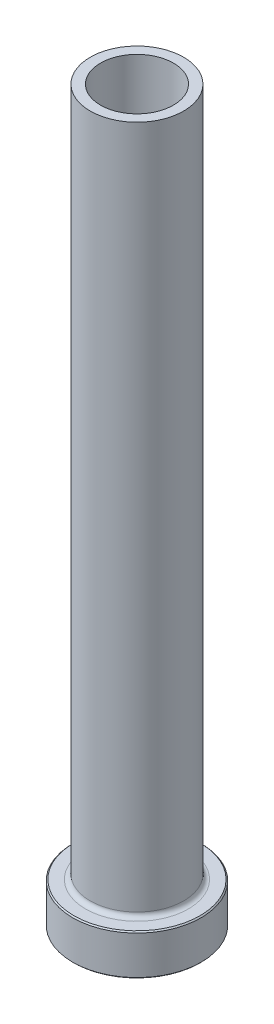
from build123d import *

# Parameters (mm, degrees)
FILLET1_R     = 0.8
CHAMFER1_SIZE = 0.2
CHAMFER3_SIZE = 0.5


with BuildPart() as part:
    # Sketch1 → Revolve1 (revolve)
    with BuildSketch(Plane.XY, mode=Mode.PRIVATE) as revolve1_sk:
        Polygon((-6.25, 125), (-8, 125), (-8, 7), (-11, 7), (-11, 0), (-6.5, 0), (-6.5, 58), (-6.25, 70), align=None)
    revolve(revolve1_sk.sketch.rotate(Axis((0, 92.187680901, 0), (0, -1, 0)), 270), axis=Axis((0, 92.187680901, 0), (0, -1, 0)))

    # Fillet1
    fillet1_edges = [part.edges().sort_by_distance(p)[0] for p in [
        (0, 7, -8),
    ]]
    fillet(fillet1_edges, radius=FILLET1_R)

    # Chamfer1
    chamfer1_edges = [part.edges().sort_by_distance(p)[0] for p in [
        (0, 0, -11),
        (0, 7, -11),
    ]]
    chamfer(chamfer1_edges, length=CHAMFER1_SIZE)

    # Chamfer3
    chamfer3_edges = [part.edges().sort_by_distance(p)[0] for p in [
        (0, 0, -6.5),
    ]]
    chamfer(chamfer3_edges, length=CHAMFER3_SIZE)


solid = part.part
